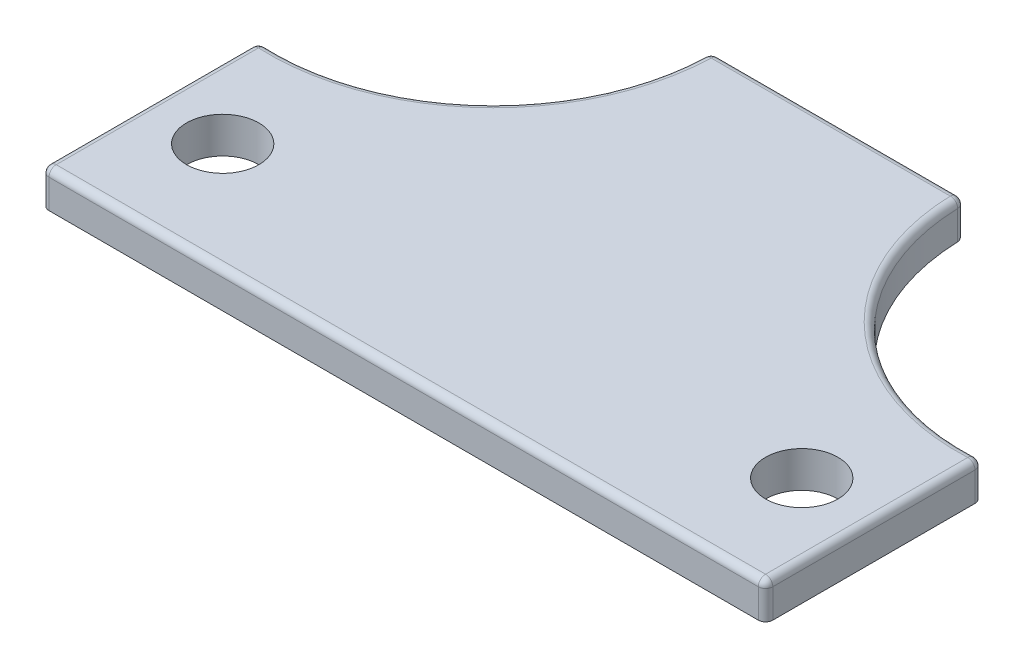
from build123d import *

# Parameters (mm, degrees)
SKETCH1_R           = 0.5
BOSS_EXTRUDE1_DEPTH = 0.5
FILLET1_R           = 0.1


with BuildPart() as part:
    # Sketch1 → Boss-Extrude1 (new body)
    with BuildSketch(Plane(origin=(0, 0, 0), x_dir=(1, 0, 0), z_dir=(0, 1, 0))):
        with BuildLine():
            Line((5, 0), (-5, 0))
            Line((-5, 0), (-5, 3))
            ThreePointArc((-5, 3), (-2.718253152, 3.788524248), (-1.75, 6))
            Line((-1.75, 6), (1.75, 6))
            ThreePointArc((1.75, 6), (2.718253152, 3.788524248), (5, 3))
            Line((5, 3), (5, 0))
        make_face()
        with Locations(Location((-4, 1.5, 0), (0, 0, 270))):
            Circle(SKETCH1_R, mode=Mode.SUBTRACT)
        with Locations(Location((4, 1.5, 0), (0, 0, 270))):
            Circle(SKETCH1_R, mode=Mode.SUBTRACT)
    extrude(amount=BOSS_EXTRUDE1_DEPTH)

    # Fillet1
    fillet1_edges = [part.edges().sort_by_distance(p)[0] for p in [
        (5, 0.5, -1.5),
        (-5, 0.25, -3),
        (-1.75, 0.25, -6),
        (1.75, 0.25, -6),
        (5, 0.25, -3),
        (5, 0.25, 0),
        (-5, 0.25, 0),
        (2.718253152, 0.5, -3.788524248),
        (0, 0.5, -6),
        (-2.718253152, 0.5, -3.788524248),
        (-5, 0.5, -1.5),
        (0, 0, -6),
        (0, 0.5, 0),
    ]]
    fillet(fillet1_edges, radius=FILLET1_R)


solid = part.part
